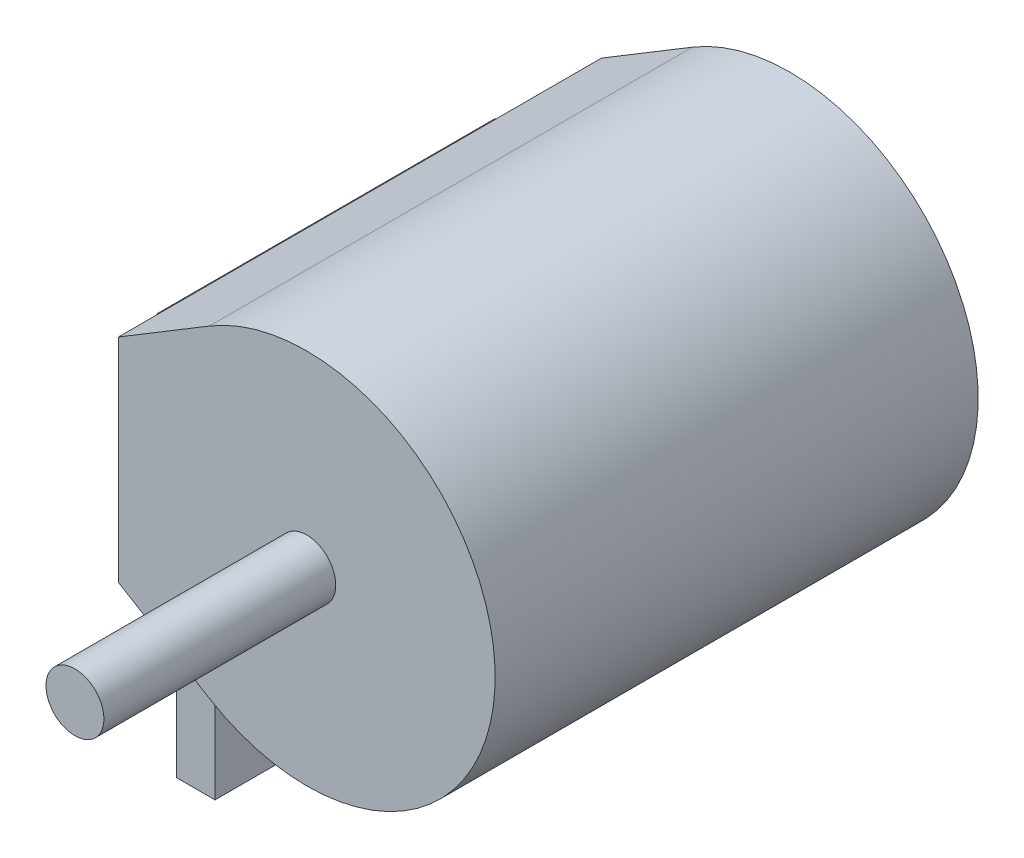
ISO-10303-21;
HEADER;
FILE_DESCRIPTION(('STEP AP214'),'2;1');
FILE_NAME('part.step','',(''),(''),'','','');
FILE_SCHEMA(('AUTOMOTIVE_DESIGN { 1 0 10303 214 1 1 1 1 }'));
ENDSEC;
DATA;
#1=APPLICATION_CONTEXT('core data for automotive mechanical design processes');
#2=APPLICATION_PROTOCOL_DEFINITION('international standard','automotive_design',2000,#1);
#3=PRODUCT_CONTEXT('',#1,'mechanical');
#4=PRODUCT('Part','Part','',(#3));
#5=PRODUCT_RELATED_PRODUCT_CATEGORY('part','',(#4));
#6=PRODUCT_DEFINITION_FORMATION('','',#4);
#7=PRODUCT_DEFINITION_CONTEXT('part definition',#1,'design');
#8=PRODUCT_DEFINITION('design','',#6,#7);
#9=PRODUCT_DEFINITION_SHAPE('','',#8);
#10=(LENGTH_UNIT() NAMED_UNIT(*) SI_UNIT(.MILLI.,.METRE.));
#11=(NAMED_UNIT(*) PLANE_ANGLE_UNIT() SI_UNIT($,.RADIAN.));
#12=(NAMED_UNIT(*) SI_UNIT($,.STERADIAN.) SOLID_ANGLE_UNIT());
#13=UNCERTAINTY_MEASURE_WITH_UNIT(LENGTH_MEASURE(1.E-05),#10,'distance_accuracy_value','');
#14=(GEOMETRIC_REPRESENTATION_CONTEXT(3) GLOBAL_UNCERTAINTY_ASSIGNED_CONTEXT((#13)) GLOBAL_UNIT_ASSIGNED_CONTEXT((#10,
#11,#12)) REPRESENTATION_CONTEXT('',''));
#15=CARTESIAN_POINT('',(0.,0.,0.));
#16=DIRECTION('',(0.,0.,1.));
#17=DIRECTION('',(1.,0.,0.));
#18=AXIS2_PLACEMENT_3D('',#15,#16,#17);
#19=CARTESIAN_POINT('',(-9.75000000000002,-5.49999999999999,12.5));
#20=DIRECTION('',(0.517206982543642,0.855860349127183,0.));
#21=DIRECTION('',(-0.855860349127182,0.51720698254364,0.));
#22=AXIS2_PLACEMENT_3D('',#19,#20,#21);
#23=PLANE('',#22);
#24=DIRECTION('',(-0.855860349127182,0.51720698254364,0.));
#25=VECTOR('',#24,1.);
#26=CARTESIAN_POINT('',(-9.74999999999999,-5.50000000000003,9.50000000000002));
#27=LINE('',#26,#25);
#28=CARTESIAN_POINT('',(-7.74999999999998,-6.70862470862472,9.50000000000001));
#29=VERTEX_POINT('',#28);
#30=CARTESIAN_POINT('',(-9.74999999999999,-5.50000000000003,9.50000000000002));
#31=VERTEX_POINT('',#30);
#32=EDGE_CURVE('E50',#29,#31,#27,.T.);
#33=ORIENTED_EDGE('',*,*,#32,.F.);
#34=DIRECTION('',(0.,0.,-1.));
#35=VECTOR('',#34,1.);
#36=CARTESIAN_POINT('',(-7.75000000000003,-6.7086247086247,12.5));
#37=LINE('',#36,#35);
#38=CARTESIAN_POINT('',(-7.75000000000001,-6.70862470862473,-9.49999999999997));
#39=VERTEX_POINT('',#38);
#40=EDGE_CURVE('E34',#29,#39,#37,.T.);
#41=ORIENTED_EDGE('',*,*,#40,.T.);
#42=DIRECTION('',(0.855860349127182,-0.51720698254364,0.));
#43=VECTOR('',#42,1.);
#44=CARTESIAN_POINT('',(-9.75000000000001,-5.50000000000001,-9.49999999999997));
#45=LINE('',#44,#43);
#46=CARTESIAN_POINT('',(-9.75000000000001,-5.50000000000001,-9.49999999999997));
#47=VERTEX_POINT('',#46);
#48=EDGE_CURVE('E153',#47,#39,#45,.T.);
#49=ORIENTED_EDGE('',*,*,#48,.F.);
#50=DIRECTION('',(0.,0.,-1.));
#51=VECTOR('',#50,1.);
#52=CARTESIAN_POINT('',(-9.75000000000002,-5.49999999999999,12.5));
#53=LINE('',#52,#51);
#54=CARTESIAN_POINT('',(-9.75000000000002,-5.50000000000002,-12.5));
#55=VERTEX_POINT('',#54);
#56=EDGE_CURVE('E271',#47,#55,#53,.T.);
#57=ORIENTED_EDGE('',*,*,#56,.T.);
#58=DIRECTION('',(0.855860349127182,-0.51720698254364,0.));
#59=VECTOR('',#58,1.);
#60=CARTESIAN_POINT('',(-9.75000000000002,-5.50000000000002,-12.5));
#61=LINE('',#60,#59);
#62=CARTESIAN_POINT('',(-5.0427680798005,-8.34463840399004,-12.5));
#63=VERTEX_POINT('',#62);
#64=EDGE_CURVE('E247',#55,#63,#61,.T.);
#65=ORIENTED_EDGE('',*,*,#64,.T.);
#66=DIRECTION('',(0.,0.,-1.));
#67=VECTOR('',#66,1.);
#68=CARTESIAN_POINT('',(-5.04276807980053,-8.34463840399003,12.5));
#69=LINE('',#68,#67);
#70=CARTESIAN_POINT('',(-5.04276807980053,-8.34463840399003,12.5));
#71=VERTEX_POINT('',#70);
#72=EDGE_CURVE('E277',#71,#63,#69,.T.);
#73=ORIENTED_EDGE('',*,*,#72,.F.);
#74=DIRECTION('',(0.855860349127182,-0.51720698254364,0.));
#75=VECTOR('',#74,1.);
#76=CARTESIAN_POINT('',(-9.75000000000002,-5.49999999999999,12.5));
#77=LINE('',#76,#75);
#78=CARTESIAN_POINT('',(-9.75000000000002,-5.49999999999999,12.5));
#79=VERTEX_POINT('',#78);
#80=EDGE_CURVE('E259',#79,#71,#77,.T.);
#81=ORIENTED_EDGE('',*,*,#80,.F.);
#82=EDGE_CURVE('E272',#79,#31,#53,.T.);
#83=ORIENTED_EDGE('',*,*,#82,.T.);
#84=EDGE_LOOP('',(#33,#41,#49,#57,#65,#73,#81,#83));
#85=FACE_BOUND('',#84,.T.);
#86=ADVANCED_FACE('F30',(#85),#23,.F.);
#87=CARTESIAN_POINT('',(0.,0.,12.5));
#88=DIRECTION('',(0.,0.,-1.));
#89=DIRECTION('',(-1.,0.,0.));
#90=AXIS2_PLACEMENT_3D('',#87,#88,#89);
#91=CYLINDRICAL_SURFACE('',#90,9.75);
#92=DIRECTION('',(0.,0.,-1.));
#93=VECTOR('',#92,1.);
#94=CARTESIAN_POINT('',(-5.04276807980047,8.34463840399,12.5));
#95=LINE('',#94,#93);
#96=CARTESIAN_POINT('',(-5.04276807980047,8.34463840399,12.5));
#97=VERTEX_POINT('',#96);
#98=CARTESIAN_POINT('',(-5.04276807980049,8.34463840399,-12.5));
#99=VERTEX_POINT('',#98);
#100=EDGE_CURVE('E276',#97,#99,#95,.T.);
#101=ORIENTED_EDGE('',*,*,#100,.F.);
#102=CARTESIAN_POINT('',(0.,0.,12.5));
#103=DIRECTION('',(0.,0.,1.));
#104=DIRECTION('',(1.,0.,0.));
#105=AXIS2_PLACEMENT_3D('',#102,#103,#104);
#106=CIRCLE('',#105,9.75);
#107=EDGE_CURVE('E262',#71,#97,#106,.T.);
#108=ORIENTED_EDGE('',*,*,#107,.F.);
#109=ORIENTED_EDGE('',*,*,#72,.T.);
#110=CARTESIAN_POINT('',(0.,0.,-12.5000000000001));
#111=DIRECTION('',(0.,0.,1.));
#112=DIRECTION('',(1.,0.,0.));
#113=AXIS2_PLACEMENT_3D('',#110,#111,#112);
#114=CIRCLE('',#113,9.75);
#115=EDGE_CURVE('E250',#63,#99,#114,.T.);
#116=ORIENTED_EDGE('',*,*,#115,.T.);
#117=EDGE_LOOP('',(#101,#108,#109,#116));
#118=FACE_BOUND('',#117,.T.);
#119=ADVANCED_FACE('F32',(#118),#91,.T.);
#120=CARTESIAN_POINT('',(-9.74999999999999,5.49999999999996,12.5));
#121=DIRECTION('',(-0.517206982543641,0.855860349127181,0.));
#122=DIRECTION('',(-0.855860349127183,-0.517206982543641,0.));
#123=AXIS2_PLACEMENT_3D('',#120,#121,#122);
#124=PLANE('',#123);
#125=DIRECTION('',(0.,0.,-1.));
#126=VECTOR('',#125,1.);
#127=CARTESIAN_POINT('',(-9.74999999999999,5.49999999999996,12.5));
#128=LINE('',#127,#126);
#129=CARTESIAN_POINT('',(-9.74999999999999,5.49999999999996,12.5));
#130=VERTEX_POINT('',#129);
#131=CARTESIAN_POINT('',(-9.74999999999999,5.49999999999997,-12.5));
#132=VERTEX_POINT('',#131);
#133=EDGE_CURVE('E274',#130,#132,#128,.T.);
#134=ORIENTED_EDGE('',*,*,#133,.F.);
#135=DIRECTION('',(0.855860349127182,0.517206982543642,0.));
#136=VECTOR('',#135,1.);
#137=CARTESIAN_POINT('',(-9.74999999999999,5.49999999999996,12.5));
#138=LINE('',#137,#136);
#139=EDGE_CURVE('E265',#130,#97,#138,.T.);
#140=ORIENTED_EDGE('',*,*,#139,.T.);
#141=ORIENTED_EDGE('',*,*,#100,.T.);
#142=DIRECTION('',(0.855860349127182,0.517206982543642,0.));
#143=VECTOR('',#142,1.);
#144=CARTESIAN_POINT('',(-9.74999999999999,5.49999999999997,-12.5));
#145=LINE('',#144,#143);
#146=EDGE_CURVE('E253',#132,#99,#145,.T.);
#147=ORIENTED_EDGE('',*,*,#146,.F.);
#148=EDGE_LOOP('',(#134,#140,#141,#147));
#149=FACE_BOUND('',#148,.T.);
#150=ADVANCED_FACE('F288',(#149),#124,.T.);
#151=CARTESIAN_POINT('',(-9.74999999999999,5.49999999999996,12.5));
#152=DIRECTION('',(1.,0.,0.));
#153=DIRECTION('',(0.,1.,0.));
#154=AXIS2_PLACEMENT_3D('',#151,#152,#153);
#155=PLANE('',#154);
#156=CARTESIAN_POINT('',(-9.75000000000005,-11.,0.));
#157=DIRECTION('',(-1.,0.,0.));
#158=DIRECTION('',(0.,-1.,0.));
#159=AXIS2_PLACEMENT_3D('',#156,#157,#158);
#160=CIRCLE('',#159,1.75);
#161=CARTESIAN_POINT('',(-9.75000000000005,-12.75,0.));
#162=VERTEX_POINT('',#161);
#163=EDGE_CURVE('E160',#162,#162,#160,.T.);
#164=ORIENTED_EDGE('',*,*,#163,.F.);
#165=EDGE_LOOP('',(#164));
#166=FACE_BOUND('',#165,.T.);
#167=DIRECTION('',(0.,0.,-1.));
#168=VECTOR('',#167,1.);
#169=CARTESIAN_POINT('',(-9.74999999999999,4.54229282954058,9.49999999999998));
#170=LINE('',#169,#168);
#171=CARTESIAN_POINT('',(-9.74999999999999,4.54229282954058,9.49999999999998));
#172=VERTEX_POINT('',#171);
#173=CARTESIAN_POINT('',(-9.75000000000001,4.54229282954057,-7.99999999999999));
#174=VERTEX_POINT('',#173);
#175=EDGE_CURVE('E220',#172,#174,#170,.T.);
#176=ORIENTED_EDGE('',*,*,#175,.F.);
#177=DIRECTION('',(0.,-1.,0.));
#178=VECTOR('',#177,1.);
#179=CARTESIAN_POINT('',(-9.74999999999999,4.54229282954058,9.49999999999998));
#180=LINE('',#179,#178);
#181=CARTESIAN_POINT('',(-9.75000000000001,-4.54229282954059,9.49999999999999));
#182=VERTEX_POINT('',#181);
#183=EDGE_CURVE('E213',#172,#182,#180,.T.);
#184=ORIENTED_EDGE('',*,*,#183,.T.);
#185=DIRECTION('',(0.,0.,1.));
#186=VECTOR('',#185,1.);
#187=CARTESIAN_POINT('',(-9.75000000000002,-4.5422928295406,-7.99999999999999));
#188=LINE('',#187,#186);
#189=CARTESIAN_POINT('',(-9.75000000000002,-4.5422928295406,-7.99999999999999));
#190=VERTEX_POINT('',#189);
#191=EDGE_CURVE('E215',#190,#182,#188,.T.);
#192=ORIENTED_EDGE('',*,*,#191,.F.);
#193=DIRECTION('',(0.,1.,0.));
#194=VECTOR('',#193,1.);
#195=CARTESIAN_POINT('',(-9.75000000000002,-4.5422928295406,-7.99999999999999));
#196=LINE('',#195,#194);
#197=EDGE_CURVE('E218',#190,#174,#196,.T.);
#198=ORIENTED_EDGE('',*,*,#197,.T.);
#199=EDGE_LOOP('',(#176,#184,#192,#198));
#200=FACE_BOUND('',#199,.T.);
#201=DIRECTION('',(0.,-1.,0.));
#202=VECTOR('',#201,1.);
#203=CARTESIAN_POINT('',(-9.74999999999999,5.49999999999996,12.5));
#204=LINE('',#203,#202);
#205=EDGE_CURVE('E268',#130,#79,#204,.T.);
#206=ORIENTED_EDGE('',*,*,#205,.F.);
#207=ORIENTED_EDGE('',*,*,#133,.T.);
#208=DIRECTION('',(0.,-1.,0.));
#209=VECTOR('',#208,1.);
#210=CARTESIAN_POINT('',(-9.74999999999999,5.49999999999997,-12.5));
#211=LINE('',#210,#209);
#212=EDGE_CURVE('E256',#132,#55,#211,.T.);
#213=ORIENTED_EDGE('',*,*,#212,.T.);
#214=ORIENTED_EDGE('',*,*,#56,.F.);
#215=DIRECTION('',(0.,1.,0.));
#216=VECTOR('',#215,1.);
#217=CARTESIAN_POINT('',(-9.75000000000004,-15.75,-9.49999999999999));
#218=LINE('',#217,#216);
#219=CARTESIAN_POINT('',(-9.75000000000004,-15.75,-9.49999999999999));
#220=VERTEX_POINT('',#219);
#221=EDGE_CURVE('E165',#220,#47,#218,.T.);
#222=ORIENTED_EDGE('',*,*,#221,.F.);
#223=DIRECTION('',(0.,0.,1.));
#224=VECTOR('',#223,1.);
#225=CARTESIAN_POINT('',(-9.75000000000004,-15.75,-9.49999999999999));
#226=LINE('',#225,#224);
#227=CARTESIAN_POINT('',(-9.75000000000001,-15.75,9.49999999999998));
#228=VERTEX_POINT('',#227);
#229=EDGE_CURVE('E147',#220,#228,#226,.T.);
#230=ORIENTED_EDGE('',*,*,#229,.T.);
#231=DIRECTION('',(0.,-1.,0.));
#232=VECTOR('',#231,1.);
#233=CARTESIAN_POINT('',(-9.74999999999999,-5.50000000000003,9.50000000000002));
#234=LINE('',#233,#232);
#235=EDGE_CURVE('E157',#31,#228,#234,.T.);
#236=ORIENTED_EDGE('',*,*,#235,.F.);
#237=ORIENTED_EDGE('',*,*,#82,.F.);
#238=EDGE_LOOP('',(#206,#207,#213,#214,#222,#230,#236,#237));
#239=FACE_BOUND('',#238,.T.);
#240=ADVANCED_FACE('F163',(#166,#200,#239),#155,.F.);
#241=CARTESIAN_POINT('',(0.,0.,12.5));
#242=DIRECTION('',(0.,0.,1.));
#243=DIRECTION('',(1.,0.,0.));
#244=AXIS2_PLACEMENT_3D('',#241,#242,#243);
#245=PLANE('',#244);
#246=CARTESIAN_POINT('',(0.,0.,12.5));
#247=DIRECTION('',(0.,0.,1.));
#248=DIRECTION('',(1.,0.,0.));
#249=AXIS2_PLACEMENT_3D('',#246,#247,#248);
#250=CIRCLE('',#249,1.5);
#251=CARTESIAN_POINT('',(1.50000000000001,0.,12.5));
#252=VERTEX_POINT('',#251);
#253=EDGE_CURVE('E11',#252,#252,#250,.T.);
#254=ORIENTED_EDGE('',*,*,#253,.F.);
#255=EDGE_LOOP('',(#254));
#256=FACE_BOUND('',#255,.T.);
#257=ORIENTED_EDGE('',*,*,#80,.T.);
#258=ORIENTED_EDGE('',*,*,#107,.T.);
#259=ORIENTED_EDGE('',*,*,#139,.F.);
#260=ORIENTED_EDGE('',*,*,#205,.T.);
#261=EDGE_LOOP('',(#257,#258,#259,#260));
#262=FACE_BOUND('',#261,.T.);
#263=ADVANCED_FACE('F291',(#256,#262),#245,.T.);
#264=CARTESIAN_POINT('',(0.,0.,-12.5000000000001));
#265=DIRECTION('',(0.,0.,1.));
#266=DIRECTION('',(1.,0.,0.));
#267=AXIS2_PLACEMENT_3D('',#264,#265,#266);
#268=PLANE('',#267);
#269=ORIENTED_EDGE('',*,*,#64,.F.);
#270=ORIENTED_EDGE('',*,*,#212,.F.);
#271=ORIENTED_EDGE('',*,*,#146,.T.);
#272=ORIENTED_EDGE('',*,*,#115,.F.);
#273=EDGE_LOOP('',(#269,#270,#271,#272));
#274=FACE_BOUND('',#273,.T.);
#275=ADVANCED_FACE('F285',(#274),#268,.F.);
#276=CARTESIAN_POINT('',(-10.75,4.54229282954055,9.49999999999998));
#277=DIRECTION('',(0.,0.,1.));
#278=DIRECTION('',(1.,0.,0.));
#279=AXIS2_PLACEMENT_3D('',#276,#277,#278);
#280=PLANE('',#279);
#281=DIRECTION('',(1.,0.,0.));
#282=VECTOR('',#281,1.);
#283=CARTESIAN_POINT('',(-10.75,4.54229282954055,9.49999999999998));
#284=LINE('',#283,#282);
#285=CARTESIAN_POINT('',(-10.75,4.54229282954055,9.49999999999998));
#286=VERTEX_POINT('',#285);
#287=EDGE_CURVE('E244',#286,#172,#284,.T.);
#288=ORIENTED_EDGE('',*,*,#287,.F.);
#289=DIRECTION('',(0.,-1.,0.));
#290=VECTOR('',#289,1.);
#291=CARTESIAN_POINT('',(-10.75,4.54229282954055,9.49999999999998));
#292=LINE('',#291,#290);
#293=CARTESIAN_POINT('',(-10.75,-4.54229282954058,9.49999999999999));
#294=VERTEX_POINT('',#293);
#295=EDGE_CURVE('E223',#286,#294,#292,.T.);
#296=ORIENTED_EDGE('',*,*,#295,.T.);
#297=DIRECTION('',(1.,0.,0.));
#298=VECTOR('',#297,1.);
#299=CARTESIAN_POINT('',(-10.75,-4.54229282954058,9.49999999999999));
#300=LINE('',#299,#298);
#301=EDGE_CURVE('E235',#294,#182,#300,.T.);
#302=ORIENTED_EDGE('',*,*,#301,.T.);
#303=ORIENTED_EDGE('',*,*,#183,.F.);
#304=EDGE_LOOP('',(#288,#296,#302,#303));
#305=FACE_BOUND('',#304,.T.);
#306=ADVANCED_FACE('F328',(#305),#280,.T.);
#307=CARTESIAN_POINT('',(-10.75,4.54229282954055,9.49999999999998));
#308=DIRECTION('',(0.,-1.,0.));
#309=DIRECTION('',(1.,0.,0.));
#310=AXIS2_PLACEMENT_3D('',#307,#308,#309);
#311=PLANE('',#310);
#312=DIRECTION('',(1.,0.,0.));
#313=VECTOR('',#312,1.);
#314=CARTESIAN_POINT('',(-10.75,4.54229282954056,-7.99999999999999));
#315=LINE('',#314,#313);
#316=CARTESIAN_POINT('',(-10.75,4.54229282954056,-7.99999999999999));
#317=VERTEX_POINT('',#316);
#318=EDGE_CURVE('E241',#317,#174,#315,.T.);
#319=ORIENTED_EDGE('',*,*,#318,.F.);
#320=DIRECTION('',(0.,0.,-1.));
#321=VECTOR('',#320,1.);
#322=CARTESIAN_POINT('',(-10.75,4.54229282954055,9.49999999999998));
#323=LINE('',#322,#321);
#324=EDGE_CURVE('E232',#286,#317,#323,.T.);
#325=ORIENTED_EDGE('',*,*,#324,.F.);
#326=ORIENTED_EDGE('',*,*,#287,.T.);
#327=ORIENTED_EDGE('',*,*,#175,.T.);
#328=EDGE_LOOP('',(#319,#325,#326,#327));
#329=FACE_BOUND('',#328,.T.);
#330=ADVANCED_FACE('F358',(#329),#311,.F.);
#331=CARTESIAN_POINT('',(-10.75,-4.54229282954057,-7.99999999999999));
#332=DIRECTION('',(0.,0.,-1.));
#333=DIRECTION('',(-1.,0.,0.));
#334=AXIS2_PLACEMENT_3D('',#331,#332,#333);
#335=PLANE('',#334);
#336=DIRECTION('',(1.,0.,0.));
#337=VECTOR('',#336,1.);
#338=CARTESIAN_POINT('',(-10.75,-4.54229282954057,-7.99999999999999));
#339=LINE('',#338,#337);
#340=CARTESIAN_POINT('',(-10.75,-4.54229282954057,-7.99999999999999));
#341=VERTEX_POINT('',#340);
#342=EDGE_CURVE('E238',#341,#190,#339,.T.);
#343=ORIENTED_EDGE('',*,*,#342,.F.);
#344=DIRECTION('',(0.,1.,0.));
#345=VECTOR('',#344,1.);
#346=CARTESIAN_POINT('',(-10.75,-4.54229282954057,-7.99999999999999));
#347=LINE('',#346,#345);
#348=EDGE_CURVE('E229',#341,#317,#347,.T.);
#349=ORIENTED_EDGE('',*,*,#348,.T.);
#350=ORIENTED_EDGE('',*,*,#318,.T.);
#351=ORIENTED_EDGE('',*,*,#197,.F.);
#352=EDGE_LOOP('',(#343,#349,#350,#351));
#353=FACE_BOUND('',#352,.T.);
#354=ADVANCED_FACE('F366',(#353),#335,.T.);
#355=CARTESIAN_POINT('',(-10.75,-4.54229282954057,-7.99999999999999));
#356=DIRECTION('',(0.,1.,0.));
#357=DIRECTION('',(-1.,0.,0.));
#358=AXIS2_PLACEMENT_3D('',#355,#356,#357);
#359=PLANE('',#358);
#360=DIRECTION('',(0.,0.,1.));
#361=VECTOR('',#360,1.);
#362=CARTESIAN_POINT('',(-10.75,-4.54229282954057,-7.99999999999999));
#363=LINE('',#362,#361);
#364=EDGE_CURVE('E226',#341,#294,#363,.T.);
#365=ORIENTED_EDGE('',*,*,#364,.F.);
#366=ORIENTED_EDGE('',*,*,#342,.T.);
#367=ORIENTED_EDGE('',*,*,#191,.T.);
#368=ORIENTED_EDGE('',*,*,#301,.F.);
#369=EDGE_LOOP('',(#365,#366,#367,#368));
#370=FACE_BOUND('',#369,.T.);
#371=ADVANCED_FACE('F363',(#370),#359,.F.);
#372=CARTESIAN_POINT('',(-10.75,-4.54229282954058,9.49999999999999));
#373=DIRECTION('',(-1.,0.,0.));
#374=DIRECTION('',(0.,0.,1.));
#375=AXIS2_PLACEMENT_3D('',#372,#373,#374);
#376=PLANE('',#375);
#377=DIRECTION('',(0.,-1.,0.));
#378=VECTOR('',#377,1.);
#379=CARTESIAN_POINT('',(-10.75,4.54229282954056,8.50000000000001));
#380=LINE('',#379,#378);
#381=CARTESIAN_POINT('',(-10.75,3.54229282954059,8.49999999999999));
#382=VERTEX_POINT('',#381);
#383=CARTESIAN_POINT('',(-10.75,-3.54229282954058,8.49999999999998));
#384=VERTEX_POINT('',#383);
#385=EDGE_CURVE('E189',#382,#384,#380,.T.);
#386=ORIENTED_EDGE('',*,*,#385,.T.);
#387=DIRECTION('',(0.,0.,1.));
#388=VECTOR('',#387,1.);
#389=CARTESIAN_POINT('',(-10.75,-3.54229282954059,-7.99999999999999));
#390=LINE('',#389,#388);
#391=CARTESIAN_POINT('',(-10.75,-3.54229282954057,-6.99999999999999));
#392=VERTEX_POINT('',#391);
#393=EDGE_CURVE('E192',#392,#384,#390,.T.);
#394=ORIENTED_EDGE('',*,*,#393,.F.);
#395=DIRECTION('',(0.,1.,0.));
#396=VECTOR('',#395,1.);
#397=CARTESIAN_POINT('',(-10.75,-4.54229282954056,-6.99999999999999));
#398=LINE('',#397,#396);
#399=CARTESIAN_POINT('',(-10.75,3.54229282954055,-6.99999999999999));
#400=VERTEX_POINT('',#399);
#401=EDGE_CURVE('E195',#392,#400,#398,.T.);
#402=ORIENTED_EDGE('',*,*,#401,.T.);
#403=DIRECTION('',(0.,0.,-1.));
#404=VECTOR('',#403,1.);
#405=CARTESIAN_POINT('',(-10.75,3.54229282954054,9.50000000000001));
#406=LINE('',#405,#404);
#407=EDGE_CURVE('E198',#382,#400,#406,.T.);
#408=ORIENTED_EDGE('',*,*,#407,.F.);
#409=EDGE_LOOP('',(#386,#394,#402,#408));
#410=FACE_BOUND('',#409,.T.);
#411=ORIENTED_EDGE('',*,*,#295,.F.);
#412=ORIENTED_EDGE('',*,*,#324,.T.);
#413=ORIENTED_EDGE('',*,*,#348,.F.);
#414=ORIENTED_EDGE('',*,*,#364,.T.);
#415=EDGE_LOOP('',(#411,#412,#413,#414));
#416=FACE_BOUND('',#415,.T.);
#417=ADVANCED_FACE('F368',(#410,#416),#376,.T.);
#418=CARTESIAN_POINT('',(-10.75,4.54229282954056,8.50000000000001));
#419=DIRECTION('',(0.,0.,1.));
#420=DIRECTION('',(1.,0.,0.));
#421=AXIS2_PLACEMENT_3D('',#418,#419,#420);
#422=PLANE('',#421);
#423=DIRECTION('',(1.,0.,0.));
#424=VECTOR('',#423,1.);
#425=CARTESIAN_POINT('',(-10.75,3.54229282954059,8.49999999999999));
#426=LINE('',#425,#424);
#427=CARTESIAN_POINT('',(-9.74999999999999,3.54229282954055,8.49999999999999));
#428=VERTEX_POINT('',#427);
#429=EDGE_CURVE('E210',#382,#428,#426,.T.);
#430=ORIENTED_EDGE('',*,*,#429,.T.);
#431=DIRECTION('',(0.,-1.,0.));
#432=VECTOR('',#431,1.);
#433=CARTESIAN_POINT('',(-9.74999999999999,4.54229282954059,8.50000000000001));
#434=LINE('',#433,#432);
#435=CARTESIAN_POINT('',(-9.75000000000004,-3.54229282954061,8.49999999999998));
#436=VERTEX_POINT('',#435);
#437=EDGE_CURVE('E179',#428,#436,#434,.T.);
#438=ORIENTED_EDGE('',*,*,#437,.T.);
#439=DIRECTION('',(1.,0.,0.));
#440=VECTOR('',#439,1.);
#441=CARTESIAN_POINT('',(-10.75,-3.54229282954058,8.49999999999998));
#442=LINE('',#441,#440);
#443=EDGE_CURVE('E201',#384,#436,#442,.T.);
#444=ORIENTED_EDGE('',*,*,#443,.F.);
#445=ORIENTED_EDGE('',*,*,#385,.F.);
#446=EDGE_LOOP('',(#430,#438,#444,#445));
#447=FACE_BOUND('',#446,.T.);
#448=ADVANCED_FACE('F370',(#447),#422,.F.);
#449=CARTESIAN_POINT('',(-10.75,3.54229282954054,9.50000000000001));
#450=DIRECTION('',(0.,-1.,0.));
#451=DIRECTION('',(1.,0.,0.));
#452=AXIS2_PLACEMENT_3D('',#449,#450,#451);
#453=PLANE('',#452);
#454=DIRECTION('',(1.,0.,0.));
#455=VECTOR('',#454,1.);
#456=CARTESIAN_POINT('',(-10.75,3.54229282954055,-6.99999999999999));
#457=LINE('',#456,#455);
#458=CARTESIAN_POINT('',(-9.74999999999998,3.54229282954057,-6.99999999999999));
#459=VERTEX_POINT('',#458);
#460=EDGE_CURVE('E207',#400,#459,#457,.T.);
#461=ORIENTED_EDGE('',*,*,#460,.T.);
#462=DIRECTION('',(0.,0.,-1.));
#463=VECTOR('',#462,1.);
#464=CARTESIAN_POINT('',(-9.75000000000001,3.54229282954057,9.50000000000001));
#465=LINE('',#464,#463);
#466=EDGE_CURVE('E187',#428,#459,#465,.T.);
#467=ORIENTED_EDGE('',*,*,#466,.F.);
#468=ORIENTED_EDGE('',*,*,#429,.F.);
#469=ORIENTED_EDGE('',*,*,#407,.T.);
#470=EDGE_LOOP('',(#461,#467,#468,#469));
#471=FACE_BOUND('',#470,.T.);
#472=ADVANCED_FACE('F377',(#471),#453,.T.);
#473=CARTESIAN_POINT('',(-10.75,-4.54229282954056,-6.99999999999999));
#474=DIRECTION('',(0.,0.,-1.));
#475=DIRECTION('',(-1.,0.,0.));
#476=AXIS2_PLACEMENT_3D('',#473,#474,#475);
#477=PLANE('',#476);
#478=DIRECTION('',(1.,0.,0.));
#479=VECTOR('',#478,1.);
#480=CARTESIAN_POINT('',(-10.75,-3.54229282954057,-6.99999999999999));
#481=LINE('',#480,#479);
#482=CARTESIAN_POINT('',(-9.75000000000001,-3.54229282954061,-6.99999999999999));
#483=VERTEX_POINT('',#482);
#484=EDGE_CURVE('E204',#392,#483,#481,.T.);
#485=ORIENTED_EDGE('',*,*,#484,.T.);
#486=DIRECTION('',(0.,1.,0.));
#487=VECTOR('',#486,1.);
#488=CARTESIAN_POINT('',(-9.75000000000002,-4.54229282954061,-6.99999999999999));
#489=LINE('',#488,#487);
#490=EDGE_CURVE('E184',#483,#459,#489,.T.);
#491=ORIENTED_EDGE('',*,*,#490,.T.);
#492=ORIENTED_EDGE('',*,*,#460,.F.);
#493=ORIENTED_EDGE('',*,*,#401,.F.);
#494=EDGE_LOOP('',(#485,#491,#492,#493));
#495=FACE_BOUND('',#494,.T.);
#496=ADVANCED_FACE('F427',(#495),#477,.F.);
#497=CARTESIAN_POINT('',(-10.75,-3.54229282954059,-7.99999999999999));
#498=DIRECTION('',(0.,1.,0.));
#499=DIRECTION('',(-1.,0.,0.));
#500=AXIS2_PLACEMENT_3D('',#497,#498,#499);
#501=PLANE('',#500);
#502=ORIENTED_EDGE('',*,*,#393,.T.);
#503=ORIENTED_EDGE('',*,*,#443,.T.);
#504=DIRECTION('',(0.,0.,1.));
#505=VECTOR('',#504,1.);
#506=CARTESIAN_POINT('',(-9.74999999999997,-3.54229282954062,-7.99999999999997));
#507=LINE('',#506,#505);
#508=EDGE_CURVE('E182',#483,#436,#507,.T.);
#509=ORIENTED_EDGE('',*,*,#508,.F.);
#510=ORIENTED_EDGE('',*,*,#484,.F.);
#511=EDGE_LOOP('',(#502,#503,#509,#510));
#512=FACE_BOUND('',#511,.T.);
#513=ADVANCED_FACE('F306',(#512),#501,.T.);
#514=ORIENTED_EDGE('',*,*,#490,.F.);
#515=ORIENTED_EDGE('',*,*,#508,.T.);
#516=ORIENTED_EDGE('',*,*,#437,.F.);
#517=ORIENTED_EDGE('',*,*,#466,.T.);
#518=EDGE_LOOP('',(#514,#515,#516,#517));
#519=FACE_BOUND('',#518,.T.);
#520=ADVANCED_FACE('F298',(#519),#155,.F.);
#521=CARTESIAN_POINT('',(-7.74999999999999,-5.50000000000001,9.50000000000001));
#522=DIRECTION('',(1.,0.,0.));
#523=DIRECTION('',(0.,0.,-1.));
#524=AXIS2_PLACEMENT_3D('',#521,#522,#523);
#525=PLANE('',#524);
#526=CARTESIAN_POINT('',(-7.75000000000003,-11.,0.));
#527=DIRECTION('',(1.,0.,0.));
#528=DIRECTION('',(0.,0.,-1.));
#529=AXIS2_PLACEMENT_3D('',#526,#527,#528);
#530=CIRCLE('',#529,1.75);
#531=CARTESIAN_POINT('',(-7.75000000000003,-11.,-1.75));
#532=VERTEX_POINT('',#531);
#533=EDGE_CURVE('E347',#532,#532,#530,.F.);
#534=ORIENTED_EDGE('',*,*,#533,.T.);
#535=EDGE_LOOP('',(#534));
#536=FACE_BOUND('',#535,.T.);
#537=ORIENTED_EDGE('',*,*,#40,.F.);
#538=DIRECTION('',(0.,-1.,0.));
#539=VECTOR('',#538,1.);
#540=CARTESIAN_POINT('',(-7.74999999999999,-5.50000000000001,9.50000000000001));
#541=LINE('',#540,#539);
#542=CARTESIAN_POINT('',(-7.75000000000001,-15.75,9.49999999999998));
#543=VERTEX_POINT('',#542);
#544=EDGE_CURVE('E167',#29,#543,#541,.T.);
#545=ORIENTED_EDGE('',*,*,#544,.T.);
#546=DIRECTION('',(0.,0.,1.));
#547=VECTOR('',#546,1.);
#548=CARTESIAN_POINT('',(-7.75000000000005,-15.75,-9.49999999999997));
#549=LINE('',#548,#547);
#550=CARTESIAN_POINT('',(-7.75000000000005,-15.75,-9.49999999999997));
#551=VERTEX_POINT('',#550);
#552=EDGE_CURVE('E150',#551,#543,#549,.T.);
#553=ORIENTED_EDGE('',*,*,#552,.F.);
#554=DIRECTION('',(0.,1.,0.));
#555=VECTOR('',#554,1.);
#556=CARTESIAN_POINT('',(-7.75000000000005,-15.75,-9.49999999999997));
#557=LINE('',#556,#555);
#558=EDGE_CURVE('E173',#551,#39,#557,.T.);
#559=ORIENTED_EDGE('',*,*,#558,.T.);
#560=EDGE_LOOP('',(#537,#545,#553,#559));
#561=FACE_BOUND('',#560,.T.);
#562=ADVANCED_FACE('F296',(#536,#561),#525,.T.);
#563=CARTESIAN_POINT('',(-7.74999999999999,-5.50000000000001,9.50000000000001));
#564=DIRECTION('',(0.,0.,-1.));
#565=DIRECTION('',(0.,1.,0.));
#566=AXIS2_PLACEMENT_3D('',#563,#564,#565);
#567=PLANE('',#566);
#568=ORIENTED_EDGE('',*,*,#544,.F.);
#569=ORIENTED_EDGE('',*,*,#32,.T.);
#570=ORIENTED_EDGE('',*,*,#235,.T.);
#571=DIRECTION('',(-1.,0.,0.));
#572=VECTOR('',#571,1.);
#573=CARTESIAN_POINT('',(-7.75000000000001,-15.75,9.49999999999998));
#574=LINE('',#573,#572);
#575=EDGE_CURVE('E143',#543,#228,#574,.T.);
#576=ORIENTED_EDGE('',*,*,#575,.F.);
#577=EDGE_LOOP('',(#568,#569,#570,#576));
#578=FACE_BOUND('',#577,.T.);
#579=ADVANCED_FACE('F158',(#578),#567,.F.);
#580=CARTESIAN_POINT('',(-7.75000000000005,-15.75,-9.49999999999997));
#581=DIRECTION('',(0.,0.,1.));
#582=DIRECTION('',(0.,-1.,0.));
#583=AXIS2_PLACEMENT_3D('',#580,#581,#582);
#584=PLANE('',#583);
#585=ORIENTED_EDGE('',*,*,#221,.T.);
#586=ORIENTED_EDGE('',*,*,#48,.T.);
#587=ORIENTED_EDGE('',*,*,#558,.F.);
#588=DIRECTION('',(-1.,0.,0.));
#589=VECTOR('',#588,1.);
#590=CARTESIAN_POINT('',(-7.75000000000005,-15.75,-9.49999999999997));
#591=LINE('',#590,#589);
#592=EDGE_CURVE('E154',#551,#220,#591,.T.);
#593=ORIENTED_EDGE('',*,*,#592,.T.);
#594=EDGE_LOOP('',(#585,#586,#587,#593));
#595=FACE_BOUND('',#594,.T.);
#596=ADVANCED_FACE('F294',(#595),#584,.F.);
#597=CARTESIAN_POINT('',(-7.75000000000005,-15.75,-9.49999999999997));
#598=DIRECTION('',(0.,-1.,0.));
#599=DIRECTION('',(1.,0.,0.));
#600=AXIS2_PLACEMENT_3D('',#597,#598,#599);
#601=PLANE('',#600);
#602=ORIENTED_EDGE('',*,*,#592,.F.);
#603=ORIENTED_EDGE('',*,*,#552,.T.);
#604=ORIENTED_EDGE('',*,*,#575,.T.);
#605=ORIENTED_EDGE('',*,*,#229,.F.);
#606=EDGE_LOOP('',(#602,#603,#604,#605));
#607=FACE_BOUND('',#606,.T.);
#608=ADVANCED_FACE('F145',(#607),#601,.T.);
#609=CARTESIAN_POINT('',(9.75099999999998,-11.,0.));
#610=DIRECTION('',(-1.,0.,0.));
#611=DIRECTION('',(0.,-1.,0.));
#612=AXIS2_PLACEMENT_3D('',#609,#610,#611);
#613=CYLINDRICAL_SURFACE('',#612,1.75);
#614=ORIENTED_EDGE('',*,*,#533,.F.);
#615=EDGE_LOOP('',(#614));
#616=FACE_BOUND('',#615,.T.);
#617=ORIENTED_EDGE('',*,*,#163,.T.);
#618=EDGE_LOOP('',(#617));
#619=FACE_BOUND('',#618,.T.);
#620=ADVANCED_FACE('F334',(#616,#619),#613,.F.);
#621=CARTESIAN_POINT('',(0.,0.,24.5));
#622=DIRECTION('',(0.,0.,-1.));
#623=DIRECTION('',(-1.,0.,0.));
#624=AXIS2_PLACEMENT_3D('',#621,#622,#623);
#625=CYLINDRICAL_SURFACE('',#624,1.5);
#626=CARTESIAN_POINT('',(0.,0.,24.5));
#627=DIRECTION('',(0.,0.,1.));
#628=DIRECTION('',(1.,0.,0.));
#629=AXIS2_PLACEMENT_3D('',#626,#627,#628);
#630=CIRCLE('',#629,1.5);
#631=CARTESIAN_POINT('',(1.49999999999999,0.,24.5));
#632=VERTEX_POINT('',#631);
#633=EDGE_CURVE('E346',#632,#632,#630,.T.);
#634=ORIENTED_EDGE('',*,*,#633,.F.);
#635=EDGE_LOOP('',(#634));
#636=FACE_BOUND('',#635,.T.);
#637=ORIENTED_EDGE('',*,*,#253,.T.);
#638=EDGE_LOOP('',(#637));
#639=FACE_BOUND('',#638,.T.);
#640=ADVANCED_FACE('F331',(#636,#639),#625,.T.);
#641=CARTESIAN_POINT('',(0.,0.,24.5));
#642=DIRECTION('',(0.,0.,1.));
#643=DIRECTION('',(1.,0.,0.));
#644=AXIS2_PLACEMENT_3D('',#641,#642,#643);
#645=PLANE('',#644);
#646=ORIENTED_EDGE('',*,*,#633,.T.);
#647=EDGE_LOOP('',(#646));
#648=FACE_BOUND('',#647,.T.);
#649=ADVANCED_FACE('F333',(#648),#645,.T.);
#650=CLOSED_SHELL('',(#86,#119,#150,#240,#263,#275,#306,#330,#354,#371,#417,#448,#472,#496,#513,
#520,#562,#579,#596,#608,#620,#640,#649));
#651=MANIFOLD_SOLID_BREP('B2',#650);
#652=ADVANCED_BREP_SHAPE_REPRESENTATION('',(#18,#651),#14);
#653=SHAPE_DEFINITION_REPRESENTATION(#9,#652);
ENDSEC;
END-ISO-10303-21;
